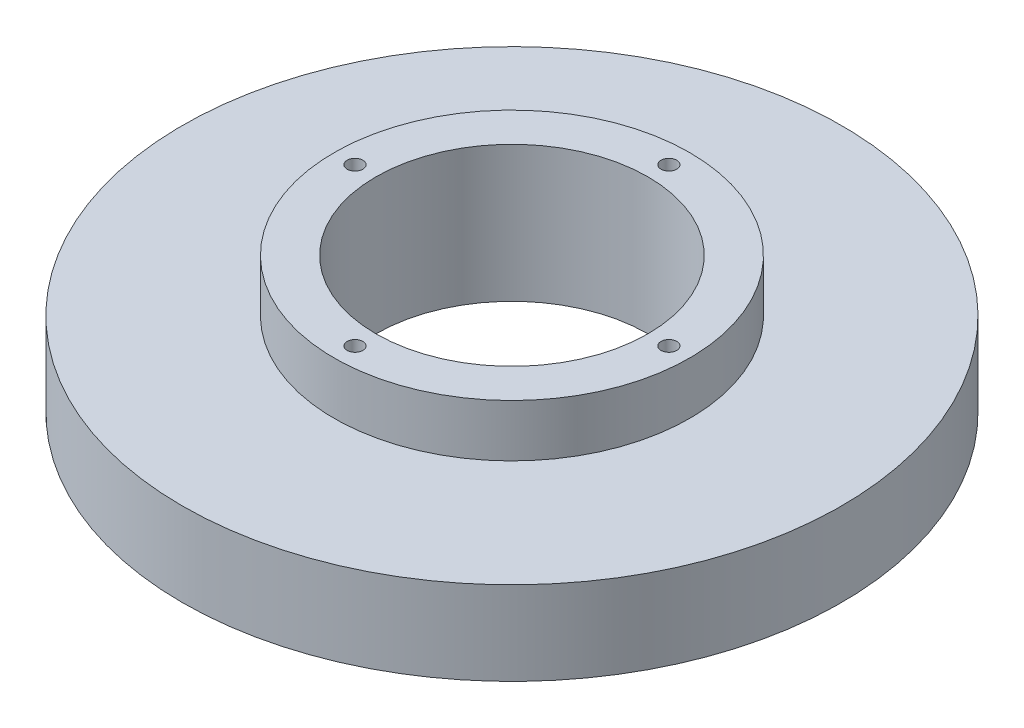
ISO-10303-21;
HEADER;
FILE_DESCRIPTION(('STEP AP214'),'2;1');
FILE_NAME('part.step','',(''),(''),'','','');
FILE_SCHEMA(('AUTOMOTIVE_DESIGN { 1 0 10303 214 1 1 1 1 }'));
ENDSEC;
DATA;
#1=APPLICATION_CONTEXT('core data for automotive mechanical design processes');
#2=APPLICATION_PROTOCOL_DEFINITION('international standard','automotive_design',2000,#1);
#3=PRODUCT_CONTEXT('',#1,'mechanical');
#4=PRODUCT('Part','Part','',(#3));
#5=PRODUCT_RELATED_PRODUCT_CATEGORY('part','',(#4));
#6=PRODUCT_DEFINITION_FORMATION('','',#4);
#7=PRODUCT_DEFINITION_CONTEXT('part definition',#1,'design');
#8=PRODUCT_DEFINITION('design','',#6,#7);
#9=PRODUCT_DEFINITION_SHAPE('','',#8);
#10=(LENGTH_UNIT() NAMED_UNIT(*) SI_UNIT(.MILLI.,.METRE.));
#11=(NAMED_UNIT(*) PLANE_ANGLE_UNIT() SI_UNIT($,.RADIAN.));
#12=(NAMED_UNIT(*) SI_UNIT($,.STERADIAN.) SOLID_ANGLE_UNIT());
#13=UNCERTAINTY_MEASURE_WITH_UNIT(LENGTH_MEASURE(1.E-05),#10,'distance_accuracy_value','');
#14=(GEOMETRIC_REPRESENTATION_CONTEXT(3) GLOBAL_UNCERTAINTY_ASSIGNED_CONTEXT((#13)) GLOBAL_UNIT_ASSIGNED_CONTEXT((#10,
#11,#12)) REPRESENTATION_CONTEXT('',''));
#15=CARTESIAN_POINT('',(0.,0.,0.));
#16=DIRECTION('',(0.,0.,1.));
#17=DIRECTION('',(1.,0.,0.));
#18=AXIS2_PLACEMENT_3D('',#15,#16,#17);
#19=CARTESIAN_POINT('',(0.,16.,0.));
#20=DIRECTION('',(0.,-1.,0.));
#21=DIRECTION('',(0.,0.,-1.));
#22=AXIS2_PLACEMENT_3D('',#19,#20,#21);
#23=CYLINDRICAL_SURFACE('',#22,63.);
#24=CARTESIAN_POINT('',(0.,16.,0.));
#25=DIRECTION('',(0.,1.,0.));
#26=DIRECTION('',(0.,0.,1.));
#27=AXIS2_PLACEMENT_3D('',#24,#25,#26);
#28=CIRCLE('',#27,63.);
#29=CARTESIAN_POINT('',(0.,16.,63.));
#30=VERTEX_POINT('',#29);
#31=EDGE_CURVE('E11',#30,#30,#28,.T.);
#32=ORIENTED_EDGE('',*,*,#31,.F.);
#33=EDGE_LOOP('',(#32));
#34=FACE_BOUND('',#33,.T.);
#35=CARTESIAN_POINT('',(0.,0.,0.));
#36=DIRECTION('',(0.,1.,0.));
#37=DIRECTION('',(0.,0.,1.));
#38=AXIS2_PLACEMENT_3D('',#35,#36,#37);
#39=CIRCLE('',#38,63.);
#40=CARTESIAN_POINT('',(0.,0.,63.));
#41=VERTEX_POINT('',#40);
#42=EDGE_CURVE('E41',#41,#41,#39,.T.);
#43=ORIENTED_EDGE('',*,*,#42,.T.);
#44=EDGE_LOOP('',(#43));
#45=FACE_BOUND('',#44,.T.);
#46=ADVANCED_FACE('F38',(#34,#45),#23,.T.);
#47=CARTESIAN_POINT('',(0.,16.,0.));
#48=DIRECTION('',(0.,1.,0.));
#49=DIRECTION('',(0.,0.,1.));
#50=AXIS2_PLACEMENT_3D('',#47,#48,#49);
#51=PLANE('',#50);
#52=CARTESIAN_POINT('',(0.,16.,0.));
#53=DIRECTION('',(0.,1.,0.));
#54=DIRECTION('',(0.,0.,1.));
#55=AXIS2_PLACEMENT_3D('',#52,#53,#54);
#56=CIRCLE('',#55,34.);
#57=CARTESIAN_POINT('',(0.,16.,-34.));
#58=VERTEX_POINT('',#57);
#59=EDGE_CURVE('E45',#58,#58,#56,.T.);
#60=ORIENTED_EDGE('',*,*,#59,.F.);
#61=EDGE_LOOP('',(#60));
#62=FACE_BOUND('',#61,.T.);
#63=ORIENTED_EDGE('',*,*,#31,.T.);
#64=EDGE_LOOP('',(#63));
#65=FACE_BOUND('',#64,.T.);
#66=ADVANCED_FACE('F118',(#62,#65),#51,.T.);
#67=CARTESIAN_POINT('',(0.,0.,0.));
#68=DIRECTION('',(0.,1.,0.));
#69=DIRECTION('',(0.,0.,1.));
#70=AXIS2_PLACEMENT_3D('',#67,#68,#69);
#71=PLANE('',#70);
#72=CARTESIAN_POINT('',(30.,0.,0.));
#73=DIRECTION('',(0.,1.,0.));
#74=DIRECTION('',(0.,0.,1.));
#75=AXIS2_PLACEMENT_3D('',#72,#73,#74);
#76=CIRCLE('',#75,1.5);
#77=CARTESIAN_POINT('',(30.,0.,1.5));
#78=VERTEX_POINT('',#77);
#79=EDGE_CURVE('E58',#78,#78,#76,.T.);
#80=ORIENTED_EDGE('',*,*,#79,.T.);
#81=EDGE_LOOP('',(#80));
#82=FACE_BOUND('',#81,.T.);
#83=CARTESIAN_POINT('',(-1.04744440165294E-13,0.,30.));
#84=DIRECTION('',(0.,1.,0.));
#85=DIRECTION('',(0.,0.,1.));
#86=AXIS2_PLACEMENT_3D('',#83,#84,#85);
#87=CIRCLE('',#86,1.5);
#88=CARTESIAN_POINT('',(-1.04744440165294E-13,0.,31.5));
#89=VERTEX_POINT('',#88);
#90=EDGE_CURVE('E76',#89,#89,#87,.T.);
#91=ORIENTED_EDGE('',*,*,#90,.T.);
#92=EDGE_LOOP('',(#91));
#93=FACE_BOUND('',#92,.T.);
#94=CARTESIAN_POINT('',(-30.,0.,-2.09488880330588E-13));
#95=DIRECTION('',(0.,1.,0.));
#96=DIRECTION('',(0.,0.,1.));
#97=AXIS2_PLACEMENT_3D('',#94,#95,#96);
#98=CIRCLE('',#97,1.5);
#99=CARTESIAN_POINT('',(-30.,0.,1.49999999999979));
#100=VERTEX_POINT('',#99);
#101=EDGE_CURVE('E70',#100,#100,#98,.T.);
#102=ORIENTED_EDGE('',*,*,#101,.T.);
#103=EDGE_LOOP('',(#102));
#104=FACE_BOUND('',#103,.T.);
#105=CARTESIAN_POINT('',(3.14233320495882E-13,0.,-30.));
#106=DIRECTION('',(0.,1.,0.));
#107=DIRECTION('',(0.,0.,1.));
#108=AXIS2_PLACEMENT_3D('',#105,#106,#107);
#109=CIRCLE('',#108,1.5);
#110=CARTESIAN_POINT('',(3.14233320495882E-13,0.,-28.5));
#111=VERTEX_POINT('',#110);
#112=EDGE_CURVE('E64',#111,#111,#109,.T.);
#113=ORIENTED_EDGE('',*,*,#112,.T.);
#114=EDGE_LOOP('',(#113));
#115=FACE_BOUND('',#114,.T.);
#116=ORIENTED_EDGE('',*,*,#42,.F.);
#117=EDGE_LOOP('',(#116));
#118=FACE_BOUND('',#117,.T.);
#119=CARTESIAN_POINT('',(0.,0.,0.));
#120=DIRECTION('',(0.,1.,0.));
#121=DIRECTION('',(0.,0.,1.));
#122=AXIS2_PLACEMENT_3D('',#119,#120,#121);
#123=CIRCLE('',#122,26.);
#124=CARTESIAN_POINT('',(0.,0.,-26.));
#125=VERTEX_POINT('',#124);
#126=EDGE_CURVE('E55',#125,#125,#123,.T.);
#127=ORIENTED_EDGE('',*,*,#126,.T.);
#128=EDGE_LOOP('',(#127));
#129=FACE_BOUND('',#128,.T.);
#130=ADVANCED_FACE('F85',(#82,#93,#104,#115,#118,#129),#71,.F.);
#131=CARTESIAN_POINT('',(0.,26.,0.));
#132=DIRECTION('',(0.,1.,0.));
#133=DIRECTION('',(0.,0.,1.));
#134=AXIS2_PLACEMENT_3D('',#131,#132,#133);
#135=PLANE('',#134);
#136=CARTESIAN_POINT('',(30.,26.,0.));
#137=DIRECTION('',(0.,1.,0.));
#138=DIRECTION('',(0.,0.,1.));
#139=AXIS2_PLACEMENT_3D('',#136,#137,#138);
#140=CIRCLE('',#139,1.5);
#141=CARTESIAN_POINT('',(30.,26.,1.5));
#142=VERTEX_POINT('',#141);
#143=EDGE_CURVE('E79',#142,#142,#140,.T.);
#144=ORIENTED_EDGE('',*,*,#143,.F.);
#145=EDGE_LOOP('',(#144));
#146=FACE_BOUND('',#145,.T.);
#147=CARTESIAN_POINT('',(-1.04744440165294E-13,26.,30.));
#148=DIRECTION('',(0.,1.,0.));
#149=DIRECTION('',(0.,0.,1.));
#150=AXIS2_PLACEMENT_3D('',#147,#148,#149);
#151=CIRCLE('',#150,1.5);
#152=CARTESIAN_POINT('',(-1.04744440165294E-13,26.,31.5));
#153=VERTEX_POINT('',#152);
#154=EDGE_CURVE('E73',#153,#153,#151,.T.);
#155=ORIENTED_EDGE('',*,*,#154,.F.);
#156=EDGE_LOOP('',(#155));
#157=FACE_BOUND('',#156,.T.);
#158=CARTESIAN_POINT('',(-30.,26.,-2.09488880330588E-13));
#159=DIRECTION('',(0.,1.,0.));
#160=DIRECTION('',(0.,0.,1.));
#161=AXIS2_PLACEMENT_3D('',#158,#159,#160);
#162=CIRCLE('',#161,1.5);
#163=CARTESIAN_POINT('',(-30.,26.,1.49999999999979));
#164=VERTEX_POINT('',#163);
#165=EDGE_CURVE('E67',#164,#164,#162,.T.);
#166=ORIENTED_EDGE('',*,*,#165,.F.);
#167=EDGE_LOOP('',(#166));
#168=FACE_BOUND('',#167,.T.);
#169=CARTESIAN_POINT('',(3.14233320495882E-13,26.,-30.));
#170=DIRECTION('',(0.,1.,0.));
#171=DIRECTION('',(0.,0.,1.));
#172=AXIS2_PLACEMENT_3D('',#169,#170,#171);
#173=CIRCLE('',#172,1.5);
#174=CARTESIAN_POINT('',(3.14233320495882E-13,26.,-28.5));
#175=VERTEX_POINT('',#174);
#176=EDGE_CURVE('E61',#175,#175,#173,.T.);
#177=ORIENTED_EDGE('',*,*,#176,.F.);
#178=EDGE_LOOP('',(#177));
#179=FACE_BOUND('',#178,.T.);
#180=CARTESIAN_POINT('',(0.,26.,0.));
#181=DIRECTION('',(0.,1.,0.));
#182=DIRECTION('',(0.,0.,1.));
#183=AXIS2_PLACEMENT_3D('',#180,#181,#182);
#184=CIRCLE('',#183,34.);
#185=CARTESIAN_POINT('',(0.,26.,-34.));
#186=VERTEX_POINT('',#185);
#187=EDGE_CURVE('E51',#186,#186,#184,.T.);
#188=ORIENTED_EDGE('',*,*,#187,.T.);
#189=EDGE_LOOP('',(#188));
#190=FACE_BOUND('',#189,.T.);
#191=CARTESIAN_POINT('',(0.,26.,0.));
#192=DIRECTION('',(0.,1.,0.));
#193=DIRECTION('',(0.,0.,1.));
#194=AXIS2_PLACEMENT_3D('',#191,#192,#193);
#195=CIRCLE('',#194,26.);
#196=CARTESIAN_POINT('',(0.,26.,-26.));
#197=VERTEX_POINT('',#196);
#198=EDGE_CURVE('E54',#197,#197,#195,.T.);
#199=ORIENTED_EDGE('',*,*,#198,.F.);
#200=EDGE_LOOP('',(#199));
#201=FACE_BOUND('',#200,.T.);
#202=ADVANCED_FACE('F95',(#146,#157,#168,#179,#190,#201),#135,.T.);
#203=CARTESIAN_POINT('',(0.,26.,0.));
#204=DIRECTION('',(0.,-1.,0.));
#205=DIRECTION('',(0.,0.,-1.));
#206=AXIS2_PLACEMENT_3D('',#203,#204,#205);
#207=CYLINDRICAL_SURFACE('',#206,34.);
#208=CARTESIAN_POINT('',(0.,16.,-34.));
#209=CARTESIAN_POINT('',(0.,16.1041666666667,-34.));
#210=CARTESIAN_POINT('',(0.,16.2083333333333,-34.));
#211=CARTESIAN_POINT('',(0.,16.4166666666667,-34.));
#212=CARTESIAN_POINT('',(0.,16.5208333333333,-34.));
#213=CARTESIAN_POINT('',(0.,16.7291666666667,-34.));
#214=CARTESIAN_POINT('',(0.,16.8333333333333,-34.));
#215=CARTESIAN_POINT('',(0.,17.0416666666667,-34.));
#216=CARTESIAN_POINT('',(0.,17.1458333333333,-34.));
#217=CARTESIAN_POINT('',(0.,17.3541666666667,-34.));
#218=CARTESIAN_POINT('',(0.,17.4583333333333,-34.));
#219=CARTESIAN_POINT('',(0.,17.6666666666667,-34.));
#220=CARTESIAN_POINT('',(0.,17.7708333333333,-34.));
#221=CARTESIAN_POINT('',(0.,17.9791666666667,-34.));
#222=CARTESIAN_POINT('',(0.,18.0833333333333,-34.));
#223=CARTESIAN_POINT('',(0.,18.2916666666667,-34.));
#224=CARTESIAN_POINT('',(0.,18.3958333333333,-34.));
#225=CARTESIAN_POINT('',(0.,18.6041666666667,-34.));
#226=CARTESIAN_POINT('',(0.,18.7083333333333,-34.));
#227=CARTESIAN_POINT('',(0.,18.9166666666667,-34.));
#228=CARTESIAN_POINT('',(0.,19.0208333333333,-34.));
#229=CARTESIAN_POINT('',(0.,19.2291666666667,-34.));
#230=CARTESIAN_POINT('',(0.,19.3333333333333,-34.));
#231=CARTESIAN_POINT('',(0.,19.5416666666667,-34.));
#232=CARTESIAN_POINT('',(0.,19.6458333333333,-34.));
#233=CARTESIAN_POINT('',(0.,19.8541666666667,-34.));
#234=CARTESIAN_POINT('',(0.,19.9583333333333,-34.));
#235=CARTESIAN_POINT('',(0.,20.1666666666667,-34.));
#236=CARTESIAN_POINT('',(0.,20.2708333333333,-34.));
#237=CARTESIAN_POINT('',(0.,20.4791666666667,-34.));
#238=CARTESIAN_POINT('',(0.,20.5833333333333,-34.));
#239=CARTESIAN_POINT('',(0.,20.7916666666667,-34.));
#240=CARTESIAN_POINT('',(0.,20.8958333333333,-34.));
#241=CARTESIAN_POINT('',(0.,21.1041666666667,-34.));
#242=CARTESIAN_POINT('',(0.,21.2083333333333,-34.));
#243=CARTESIAN_POINT('',(0.,21.4166666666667,-34.));
#244=CARTESIAN_POINT('',(0.,21.5208333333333,-34.));
#245=CARTESIAN_POINT('',(0.,21.7291666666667,-34.));
#246=CARTESIAN_POINT('',(0.,21.8333333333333,-34.));
#247=CARTESIAN_POINT('',(0.,22.0416666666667,-34.));
#248=CARTESIAN_POINT('',(0.,22.1458333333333,-34.));
#249=CARTESIAN_POINT('',(0.,22.3541666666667,-34.));
#250=CARTESIAN_POINT('',(0.,22.4583333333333,-34.));
#251=CARTESIAN_POINT('',(0.,22.6666666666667,-34.));
#252=CARTESIAN_POINT('',(0.,22.7708333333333,-34.));
#253=CARTESIAN_POINT('',(0.,22.9791666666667,-34.));
#254=CARTESIAN_POINT('',(0.,23.0833333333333,-34.));
#255=CARTESIAN_POINT('',(0.,23.2916666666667,-34.));
#256=CARTESIAN_POINT('',(0.,23.3958333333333,-34.));
#257=CARTESIAN_POINT('',(0.,23.6041666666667,-34.));
#258=CARTESIAN_POINT('',(0.,23.7083333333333,-34.));
#259=CARTESIAN_POINT('',(0.,23.9166666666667,-34.));
#260=CARTESIAN_POINT('',(0.,24.0208333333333,-34.));
#261=CARTESIAN_POINT('',(0.,24.2291666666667,-34.));
#262=CARTESIAN_POINT('',(0.,24.3333333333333,-34.));
#263=CARTESIAN_POINT('',(0.,24.5416666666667,-34.));
#264=CARTESIAN_POINT('',(0.,24.6458333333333,-34.));
#265=CARTESIAN_POINT('',(0.,24.8541666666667,-34.));
#266=CARTESIAN_POINT('',(0.,24.9583333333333,-34.));
#267=CARTESIAN_POINT('',(0.,25.1666666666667,-34.));
#268=CARTESIAN_POINT('',(0.,25.2708333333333,-34.));
#269=CARTESIAN_POINT('',(0.,25.4791666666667,-34.));
#270=CARTESIAN_POINT('',(0.,25.5833333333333,-34.));
#271=CARTESIAN_POINT('',(0.,25.7916666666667,-34.));
#272=CARTESIAN_POINT('',(0.,25.8958333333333,-34.));
#273=CARTESIAN_POINT('',(0.,26.,-34.));
#274=B_SPLINE_CURVE_WITH_KNOTS('',3,(#208,#209,#210,#211,#212,#213,#214,#215,#216,#217,#218,
#219,#220,#221,#222,#223,#224,#225,#226,#227,#228,#229,#230,#231,#232,#233,#234,#235,#236,#237,
#238,#239,#240,#241,#242,#243,#244,#245,#246,#247,#248,#249,#250,#251,#252,#253,#254,#255,#256,
#257,#258,#259,#260,#261,#262,#263,#264,#265,#266,#267,#268,#269,#270,#271,#272,#273),
.UNSPECIFIED.,.F.,.F.,(4,2,2,2,2,2,2,2,2,2,2,2,2,2,2,2,2,2,2,2,2,2,2,2,2,2,2,2,2,2,2,2,4),(0.,
0.3125,0.625000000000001,0.937500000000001,1.25,1.5625,1.875,2.1875,2.5,2.8125,3.125,3.4375,
3.75,4.0625,4.375,4.6875,5.,5.3125,5.625,5.9375,6.25,6.5625,6.875,7.1875,7.5,7.8125,8.125,
8.4375,8.75,9.0625,9.375,9.6875,10.),.UNSPECIFIED.);
#275=EDGE_CURVE('BSEAM98',#58,#186,#274,.T.);
#276=ORIENTED_EDGE('',*,*,#59,.T.);
#277=ORIENTED_EDGE('',*,*,#187,.F.);
#278=ORIENTED_EDGE('',*,*,#275,.T.);
#279=ORIENTED_EDGE('',*,*,#275,.F.);
#280=EDGE_LOOP('',(#276,#278,#277,#279));
#281=FACE_BOUND('',#280,.T.);
#282=ADVANCED_FACE('F98',(#281),#207,.T.);
#283=CARTESIAN_POINT('',(0.,26.,0.));
#284=DIRECTION('',(0.,-1.,0.));
#285=DIRECTION('',(0.,0.,-1.));
#286=AXIS2_PLACEMENT_3D('',#283,#284,#285);
#287=CYLINDRICAL_SURFACE('',#286,26.);
#288=CARTESIAN_POINT('',(0.,26.,-26.));
#289=CARTESIAN_POINT('',(0.,25.7291666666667,-26.));
#290=CARTESIAN_POINT('',(0.,25.4583333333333,-26.));
#291=CARTESIAN_POINT('',(0.,24.9166666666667,-26.));
#292=CARTESIAN_POINT('',(0.,24.6458333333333,-26.));
#293=CARTESIAN_POINT('',(0.,24.1041666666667,-26.));
#294=CARTESIAN_POINT('',(0.,23.8333333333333,-26.));
#295=CARTESIAN_POINT('',(0.,23.2916666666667,-26.));
#296=CARTESIAN_POINT('',(0.,23.0208333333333,-26.));
#297=CARTESIAN_POINT('',(0.,22.4791666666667,-26.));
#298=CARTESIAN_POINT('',(0.,22.2083333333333,-26.));
#299=CARTESIAN_POINT('',(0.,21.6666666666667,-26.));
#300=CARTESIAN_POINT('',(0.,21.3958333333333,-26.));
#301=CARTESIAN_POINT('',(0.,20.8541666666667,-26.));
#302=CARTESIAN_POINT('',(0.,20.5833333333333,-26.));
#303=CARTESIAN_POINT('',(0.,20.0416666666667,-26.));
#304=CARTESIAN_POINT('',(0.,19.7708333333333,-26.));
#305=CARTESIAN_POINT('',(0.,19.2291666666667,-26.));
#306=CARTESIAN_POINT('',(0.,18.9583333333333,-26.));
#307=CARTESIAN_POINT('',(0.,18.4166666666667,-26.));
#308=CARTESIAN_POINT('',(0.,18.1458333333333,-26.));
#309=CARTESIAN_POINT('',(0.,17.6041666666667,-26.));
#310=CARTESIAN_POINT('',(0.,17.3333333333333,-26.));
#311=CARTESIAN_POINT('',(0.,16.7916666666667,-26.));
#312=CARTESIAN_POINT('',(0.,16.5208333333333,-26.));
#313=CARTESIAN_POINT('',(0.,15.9791666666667,-26.));
#314=CARTESIAN_POINT('',(0.,15.7083333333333,-26.));
#315=CARTESIAN_POINT('',(0.,15.1666666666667,-26.));
#316=CARTESIAN_POINT('',(0.,14.8958333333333,-26.));
#317=CARTESIAN_POINT('',(0.,14.3541666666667,-26.));
#318=CARTESIAN_POINT('',(0.,14.0833333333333,-26.));
#319=CARTESIAN_POINT('',(0.,13.5416666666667,-26.));
#320=CARTESIAN_POINT('',(0.,13.2708333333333,-26.));
#321=CARTESIAN_POINT('',(0.,12.7291666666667,-26.));
#322=CARTESIAN_POINT('',(0.,12.4583333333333,-26.));
#323=CARTESIAN_POINT('',(0.,11.9166666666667,-26.));
#324=CARTESIAN_POINT('',(0.,11.6458333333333,-26.));
#325=CARTESIAN_POINT('',(0.,11.1041666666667,-26.));
#326=CARTESIAN_POINT('',(0.,10.8333333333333,-26.));
#327=CARTESIAN_POINT('',(0.,10.2916666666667,-26.));
#328=CARTESIAN_POINT('',(0.,10.0208333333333,-26.));
#329=CARTESIAN_POINT('',(0.,9.47916666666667,-26.));
#330=CARTESIAN_POINT('',(0.,9.20833333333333,-26.));
#331=CARTESIAN_POINT('',(0.,8.66666666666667,-26.));
#332=CARTESIAN_POINT('',(0.,8.39583333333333,-26.));
#333=CARTESIAN_POINT('',(0.,7.85416666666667,-26.));
#334=CARTESIAN_POINT('',(0.,7.58333333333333,-26.));
#335=CARTESIAN_POINT('',(0.,7.04166666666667,-26.));
#336=CARTESIAN_POINT('',(0.,6.77083333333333,-26.));
#337=CARTESIAN_POINT('',(0.,6.22916666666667,-26.));
#338=CARTESIAN_POINT('',(0.,5.95833333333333,-26.));
#339=CARTESIAN_POINT('',(0.,5.41666666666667,-26.));
#340=CARTESIAN_POINT('',(0.,5.14583333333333,-26.));
#341=CARTESIAN_POINT('',(0.,4.60416666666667,-26.));
#342=CARTESIAN_POINT('',(0.,4.33333333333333,-26.));
#343=CARTESIAN_POINT('',(0.,3.79166666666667,-26.));
#344=CARTESIAN_POINT('',(0.,3.52083333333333,-26.));
#345=CARTESIAN_POINT('',(0.,2.97916666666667,-26.));
#346=CARTESIAN_POINT('',(0.,2.70833333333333,-26.));
#347=CARTESIAN_POINT('',(0.,2.16666666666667,-26.));
#348=CARTESIAN_POINT('',(0.,1.89583333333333,-26.));
#349=CARTESIAN_POINT('',(0.,1.35416666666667,-26.));
#350=CARTESIAN_POINT('',(0.,1.08333333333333,-26.));
#351=CARTESIAN_POINT('',(0.,0.541666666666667,-26.));
#352=CARTESIAN_POINT('',(0.,0.270833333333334,-26.));
#353=CARTESIAN_POINT('',(0.,0.,-26.));
#354=B_SPLINE_CURVE_WITH_KNOTS('',3,(#288,#289,#290,#291,#292,#293,#294,#295,#296,#297,#298,
#299,#300,#301,#302,#303,#304,#305,#306,#307,#308,#309,#310,#311,#312,#313,#314,#315,#316,#317,
#318,#319,#320,#321,#322,#323,#324,#325,#326,#327,#328,#329,#330,#331,#332,#333,#334,#335,#336,
#337,#338,#339,#340,#341,#342,#343,#344,#345,#346,#347,#348,#349,#350,#351,#352,#353),
.UNSPECIFIED.,.F.,.F.,(4,2,2,2,2,2,2,2,2,2,2,2,2,2,2,2,2,2,2,2,2,2,2,2,2,2,2,2,2,2,2,2,4),(0.,
0.812499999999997,1.625,2.4375,3.25,4.0625,4.875,5.6875,6.5,7.3125,8.125,8.93749999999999,
9.74999999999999,10.5625,11.375,12.1875,13.,13.8125,14.625,15.4375,16.25,17.0625,17.875,18.6875,
19.5,20.3125,21.125,21.9375,22.75,23.5625,24.375,25.1875,26.),.UNSPECIFIED.);
#355=EDGE_CURVE('BSEAM110',#197,#125,#354,.T.);
#356=ORIENTED_EDGE('',*,*,#198,.T.);
#357=ORIENTED_EDGE('',*,*,#126,.F.);
#358=ORIENTED_EDGE('',*,*,#355,.T.);
#359=ORIENTED_EDGE('',*,*,#355,.F.);
#360=EDGE_LOOP('',(#356,#358,#357,#359));
#361=FACE_BOUND('',#360,.T.);
#362=ADVANCED_FACE('F110',(#361),#287,.F.);
#363=CARTESIAN_POINT('',(3.14233320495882E-13,0.,-30.));
#364=DIRECTION('',(0.,1.,0.));
#365=DIRECTION('',(0.,0.,1.));
#366=AXIS2_PLACEMENT_3D('',#363,#364,#365);
#367=CYLINDRICAL_SURFACE('',#366,1.5);
#368=CARTESIAN_POINT('',(3.14233320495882E-13,0.,-28.5));
#369=CARTESIAN_POINT('',(3.14233320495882E-13,0.270833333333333,-28.5));
#370=CARTESIAN_POINT('',(3.14233320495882E-13,0.541666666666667,-28.5));
#371=CARTESIAN_POINT('',(3.14233320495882E-13,1.08333333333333,-28.5));
#372=CARTESIAN_POINT('',(3.14233320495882E-13,1.35416666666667,-28.5));
#373=CARTESIAN_POINT('',(3.14233320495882E-13,1.89583333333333,-28.5));
#374=CARTESIAN_POINT('',(3.14233320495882E-13,2.16666666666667,-28.5));
#375=CARTESIAN_POINT('',(3.14233320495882E-13,2.70833333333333,-28.5));
#376=CARTESIAN_POINT('',(3.14233320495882E-13,2.97916666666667,-28.5));
#377=CARTESIAN_POINT('',(3.14233320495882E-13,3.52083333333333,-28.5));
#378=CARTESIAN_POINT('',(3.14233320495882E-13,3.79166666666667,-28.5));
#379=CARTESIAN_POINT('',(3.14233320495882E-13,4.33333333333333,-28.5));
#380=CARTESIAN_POINT('',(3.14233320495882E-13,4.60416666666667,-28.5));
#381=CARTESIAN_POINT('',(3.14233320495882E-13,5.14583333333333,-28.5));
#382=CARTESIAN_POINT('',(3.14233320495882E-13,5.41666666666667,-28.5));
#383=CARTESIAN_POINT('',(3.14233320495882E-13,5.95833333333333,-28.5));
#384=CARTESIAN_POINT('',(3.14233320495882E-13,6.22916666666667,-28.5));
#385=CARTESIAN_POINT('',(3.14233320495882E-13,6.77083333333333,-28.5));
#386=CARTESIAN_POINT('',(3.14233320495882E-13,7.04166666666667,-28.5));
#387=CARTESIAN_POINT('',(3.14233320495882E-13,7.58333333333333,-28.5));
#388=CARTESIAN_POINT('',(3.14233320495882E-13,7.85416666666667,-28.5));
#389=CARTESIAN_POINT('',(3.14233320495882E-13,8.39583333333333,-28.5));
#390=CARTESIAN_POINT('',(3.14233320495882E-13,8.66666666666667,-28.5));
#391=CARTESIAN_POINT('',(3.14233320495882E-13,9.20833333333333,-28.5));
#392=CARTESIAN_POINT('',(3.14233320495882E-13,9.47916666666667,-28.5));
#393=CARTESIAN_POINT('',(3.14233320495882E-13,10.0208333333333,-28.5));
#394=CARTESIAN_POINT('',(3.14233320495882E-13,10.2916666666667,-28.5));
#395=CARTESIAN_POINT('',(3.14233320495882E-13,10.8333333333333,-28.5));
#396=CARTESIAN_POINT('',(3.14233320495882E-13,11.1041666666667,-28.5));
#397=CARTESIAN_POINT('',(3.14233320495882E-13,11.6458333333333,-28.5));
#398=CARTESIAN_POINT('',(3.14233320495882E-13,11.9166666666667,-28.5));
#399=CARTESIAN_POINT('',(3.14233320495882E-13,12.4583333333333,-28.5));
#400=CARTESIAN_POINT('',(3.14233320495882E-13,12.7291666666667,-28.5));
#401=CARTESIAN_POINT('',(3.14233320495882E-13,13.2708333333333,-28.5));
#402=CARTESIAN_POINT('',(3.14233320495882E-13,13.5416666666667,-28.5));
#403=CARTESIAN_POINT('',(3.14233320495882E-13,14.0833333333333,-28.5));
#404=CARTESIAN_POINT('',(3.14233320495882E-13,14.3541666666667,-28.5));
#405=CARTESIAN_POINT('',(3.14233320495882E-13,14.8958333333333,-28.5));
#406=CARTESIAN_POINT('',(3.14233320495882E-13,15.1666666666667,-28.5));
#407=CARTESIAN_POINT('',(3.14233320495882E-13,15.7083333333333,-28.5));
#408=CARTESIAN_POINT('',(3.14233320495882E-13,15.9791666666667,-28.5));
#409=CARTESIAN_POINT('',(3.14233320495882E-13,16.5208333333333,-28.5));
#410=CARTESIAN_POINT('',(3.14233320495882E-13,16.7916666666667,-28.5));
#411=CARTESIAN_POINT('',(3.14233320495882E-13,17.3333333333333,-28.5));
#412=CARTESIAN_POINT('',(3.14233320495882E-13,17.6041666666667,-28.5));
#413=CARTESIAN_POINT('',(3.14233320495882E-13,18.1458333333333,-28.5));
#414=CARTESIAN_POINT('',(3.14233320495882E-13,18.4166666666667,-28.5));
#415=CARTESIAN_POINT('',(3.14233320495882E-13,18.9583333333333,-28.5));
#416=CARTESIAN_POINT('',(3.14233320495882E-13,19.2291666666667,-28.5));
#417=CARTESIAN_POINT('',(3.14233320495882E-13,19.7708333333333,-28.5));
#418=CARTESIAN_POINT('',(3.14233320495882E-13,20.0416666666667,-28.5));
#419=CARTESIAN_POINT('',(3.14233320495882E-13,20.5833333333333,-28.5));
#420=CARTESIAN_POINT('',(3.14233320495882E-13,20.8541666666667,-28.5));
#421=CARTESIAN_POINT('',(3.14233320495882E-13,21.3958333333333,-28.5));
#422=CARTESIAN_POINT('',(3.14233320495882E-13,21.6666666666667,-28.5));
#423=CARTESIAN_POINT('',(3.14233320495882E-13,22.2083333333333,-28.5));
#424=CARTESIAN_POINT('',(3.14233320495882E-13,22.4791666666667,-28.5));
#425=CARTESIAN_POINT('',(3.14233320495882E-13,23.0208333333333,-28.5));
#426=CARTESIAN_POINT('',(3.14233320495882E-13,23.2916666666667,-28.5));
#427=CARTESIAN_POINT('',(3.14233320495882E-13,23.8333333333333,-28.5));
#428=CARTESIAN_POINT('',(3.14233320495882E-13,24.1041666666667,-28.5));
#429=CARTESIAN_POINT('',(3.14233320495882E-13,24.6458333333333,-28.5));
#430=CARTESIAN_POINT('',(3.14233320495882E-13,24.9166666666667,-28.5));
#431=CARTESIAN_POINT('',(3.14233320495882E-13,25.4583333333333,-28.5));
#432=CARTESIAN_POINT('',(3.14233320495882E-13,25.7291666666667,-28.5));
#433=CARTESIAN_POINT('',(3.14233320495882E-13,26.,-28.5));
#434=B_SPLINE_CURVE_WITH_KNOTS('',3,(#368,#369,#370,#371,#372,#373,#374,#375,#376,#377,#378,
#379,#380,#381,#382,#383,#384,#385,#386,#387,#388,#389,#390,#391,#392,#393,#394,#395,#396,#397,
#398,#399,#400,#401,#402,#403,#404,#405,#406,#407,#408,#409,#410,#411,#412,#413,#414,#415,#416,
#417,#418,#419,#420,#421,#422,#423,#424,#425,#426,#427,#428,#429,#430,#431,#432,#433),
.UNSPECIFIED.,.F.,.F.,(4,2,2,2,2,2,2,2,2,2,2,2,2,2,2,2,2,2,2,2,2,2,2,2,2,2,2,2,2,2,2,2,4),(0.,
0.8125,1.625,2.4375,3.25,4.0625,4.875,5.6875,6.5,7.3125,8.125,8.9375,9.75,10.5625,11.375,
12.1875,13.,13.8125,14.625,15.4375,16.25,17.0625,17.875,18.6875,19.5,20.3125,21.125,21.9375,
22.75,23.5625,24.375,25.1875,26.),.UNSPECIFIED.);
#435=EDGE_CURVE('BSEAM113',#111,#175,#434,.T.);
#436=ORIENTED_EDGE('',*,*,#112,.F.);
#437=ORIENTED_EDGE('',*,*,#176,.T.);
#438=ORIENTED_EDGE('',*,*,#435,.T.);
#439=ORIENTED_EDGE('',*,*,#435,.F.);
#440=EDGE_LOOP('',(#436,#438,#437,#439));
#441=FACE_BOUND('',#440,.T.);
#442=ADVANCED_FACE('F113',(#441),#367,.F.);
#443=CARTESIAN_POINT('',(-30.,0.,-2.09488880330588E-13));
#444=DIRECTION('',(0.,1.,0.));
#445=DIRECTION('',(0.,0.,1.));
#446=AXIS2_PLACEMENT_3D('',#443,#444,#445);
#447=CYLINDRICAL_SURFACE('',#446,1.5);
#448=CARTESIAN_POINT('',(-30.,0.,1.49999999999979));
#449=CARTESIAN_POINT('',(-30.,0.270833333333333,1.49999999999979));
#450=CARTESIAN_POINT('',(-30.,0.541666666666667,1.49999999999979));
#451=CARTESIAN_POINT('',(-30.,1.08333333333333,1.49999999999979));
#452=CARTESIAN_POINT('',(-30.,1.35416666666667,1.49999999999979));
#453=CARTESIAN_POINT('',(-30.,1.89583333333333,1.49999999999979));
#454=CARTESIAN_POINT('',(-30.,2.16666666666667,1.49999999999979));
#455=CARTESIAN_POINT('',(-30.,2.70833333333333,1.49999999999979));
#456=CARTESIAN_POINT('',(-30.,2.97916666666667,1.49999999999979));
#457=CARTESIAN_POINT('',(-30.,3.52083333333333,1.49999999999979));
#458=CARTESIAN_POINT('',(-30.,3.79166666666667,1.49999999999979));
#459=CARTESIAN_POINT('',(-30.,4.33333333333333,1.49999999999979));
#460=CARTESIAN_POINT('',(-30.,4.60416666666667,1.49999999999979));
#461=CARTESIAN_POINT('',(-30.,5.14583333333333,1.49999999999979));
#462=CARTESIAN_POINT('',(-30.,5.41666666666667,1.49999999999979));
#463=CARTESIAN_POINT('',(-30.,5.95833333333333,1.49999999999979));
#464=CARTESIAN_POINT('',(-30.,6.22916666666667,1.49999999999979));
#465=CARTESIAN_POINT('',(-30.,6.77083333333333,1.49999999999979));
#466=CARTESIAN_POINT('',(-30.,7.04166666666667,1.49999999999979));
#467=CARTESIAN_POINT('',(-30.,7.58333333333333,1.49999999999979));
#468=CARTESIAN_POINT('',(-30.,7.85416666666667,1.49999999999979));
#469=CARTESIAN_POINT('',(-30.,8.39583333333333,1.49999999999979));
#470=CARTESIAN_POINT('',(-30.,8.66666666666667,1.49999999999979));
#471=CARTESIAN_POINT('',(-30.,9.20833333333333,1.49999999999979));
#472=CARTESIAN_POINT('',(-30.,9.47916666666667,1.49999999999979));
#473=CARTESIAN_POINT('',(-30.,10.0208333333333,1.49999999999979));
#474=CARTESIAN_POINT('',(-30.,10.2916666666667,1.49999999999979));
#475=CARTESIAN_POINT('',(-30.,10.8333333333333,1.49999999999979));
#476=CARTESIAN_POINT('',(-30.,11.1041666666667,1.49999999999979));
#477=CARTESIAN_POINT('',(-30.,11.6458333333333,1.49999999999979));
#478=CARTESIAN_POINT('',(-30.,11.9166666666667,1.49999999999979));
#479=CARTESIAN_POINT('',(-30.,12.4583333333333,1.49999999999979));
#480=CARTESIAN_POINT('',(-30.,12.7291666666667,1.49999999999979));
#481=CARTESIAN_POINT('',(-30.,13.2708333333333,1.49999999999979));
#482=CARTESIAN_POINT('',(-30.,13.5416666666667,1.49999999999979));
#483=CARTESIAN_POINT('',(-30.,14.0833333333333,1.49999999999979));
#484=CARTESIAN_POINT('',(-30.,14.3541666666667,1.49999999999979));
#485=CARTESIAN_POINT('',(-30.,14.8958333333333,1.49999999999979));
#486=CARTESIAN_POINT('',(-30.,15.1666666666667,1.49999999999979));
#487=CARTESIAN_POINT('',(-30.,15.7083333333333,1.49999999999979));
#488=CARTESIAN_POINT('',(-30.,15.9791666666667,1.49999999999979));
#489=CARTESIAN_POINT('',(-30.,16.5208333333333,1.49999999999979));
#490=CARTESIAN_POINT('',(-30.,16.7916666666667,1.49999999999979));
#491=CARTESIAN_POINT('',(-30.,17.3333333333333,1.49999999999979));
#492=CARTESIAN_POINT('',(-30.,17.6041666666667,1.49999999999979));
#493=CARTESIAN_POINT('',(-30.,18.1458333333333,1.49999999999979));
#494=CARTESIAN_POINT('',(-30.,18.4166666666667,1.49999999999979));
#495=CARTESIAN_POINT('',(-30.,18.9583333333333,1.49999999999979));
#496=CARTESIAN_POINT('',(-30.,19.2291666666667,1.49999999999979));
#497=CARTESIAN_POINT('',(-30.,19.7708333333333,1.49999999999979));
#498=CARTESIAN_POINT('',(-30.,20.0416666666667,1.49999999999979));
#499=CARTESIAN_POINT('',(-30.,20.5833333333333,1.49999999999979));
#500=CARTESIAN_POINT('',(-30.,20.8541666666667,1.49999999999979));
#501=CARTESIAN_POINT('',(-30.,21.3958333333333,1.49999999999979));
#502=CARTESIAN_POINT('',(-30.,21.6666666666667,1.49999999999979));
#503=CARTESIAN_POINT('',(-30.,22.2083333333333,1.49999999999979));
#504=CARTESIAN_POINT('',(-30.,22.4791666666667,1.49999999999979));
#505=CARTESIAN_POINT('',(-30.,23.0208333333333,1.49999999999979));
#506=CARTESIAN_POINT('',(-30.,23.2916666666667,1.49999999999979));
#507=CARTESIAN_POINT('',(-30.,23.8333333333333,1.49999999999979));
#508=CARTESIAN_POINT('',(-30.,24.1041666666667,1.49999999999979));
#509=CARTESIAN_POINT('',(-30.,24.6458333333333,1.49999999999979));
#510=CARTESIAN_POINT('',(-30.,24.9166666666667,1.49999999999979));
#511=CARTESIAN_POINT('',(-30.,25.4583333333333,1.49999999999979));
#512=CARTESIAN_POINT('',(-30.,25.7291666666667,1.49999999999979));
#513=CARTESIAN_POINT('',(-30.,26.,1.49999999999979));
#514=B_SPLINE_CURVE_WITH_KNOTS('',3,(#448,#449,#450,#451,#452,#453,#454,#455,#456,#457,#458,
#459,#460,#461,#462,#463,#464,#465,#466,#467,#468,#469,#470,#471,#472,#473,#474,#475,#476,#477,
#478,#479,#480,#481,#482,#483,#484,#485,#486,#487,#488,#489,#490,#491,#492,#493,#494,#495,#496,
#497,#498,#499,#500,#501,#502,#503,#504,#505,#506,#507,#508,#509,#510,#511,#512,#513),
.UNSPECIFIED.,.F.,.F.,(4,2,2,2,2,2,2,2,2,2,2,2,2,2,2,2,2,2,2,2,2,2,2,2,2,2,2,2,2,2,2,2,4),(0.,
0.8125,1.625,2.4375,3.25,4.0625,4.875,5.6875,6.5,7.3125,8.125,8.9375,9.75,10.5625,11.375,
12.1875,13.,13.8125,14.625,15.4375,16.25,17.0625,17.875,18.6875,19.5,20.3125,21.125,21.9375,
22.75,23.5625,24.375,25.1875,26.),.UNSPECIFIED.);
#515=EDGE_CURVE('BSEAM164',#100,#164,#514,.T.);
#516=ORIENTED_EDGE('',*,*,#101,.F.);
#517=ORIENTED_EDGE('',*,*,#165,.T.);
#518=ORIENTED_EDGE('',*,*,#515,.T.);
#519=ORIENTED_EDGE('',*,*,#515,.F.);
#520=EDGE_LOOP('',(#516,#518,#517,#519));
#521=FACE_BOUND('',#520,.T.);
#522=ADVANCED_FACE('F164',(#521),#447,.F.);
#523=CARTESIAN_POINT('',(-1.04744440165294E-13,0.,30.));
#524=DIRECTION('',(0.,1.,0.));
#525=DIRECTION('',(0.,0.,1.));
#526=AXIS2_PLACEMENT_3D('',#523,#524,#525);
#527=CYLINDRICAL_SURFACE('',#526,1.5);
#528=CARTESIAN_POINT('',(-1.04744440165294E-13,0.,31.5));
#529=CARTESIAN_POINT('',(-1.04744440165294E-13,0.270833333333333,31.5));
#530=CARTESIAN_POINT('',(-1.04744440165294E-13,0.541666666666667,31.5));
#531=CARTESIAN_POINT('',(-1.04744440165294E-13,1.08333333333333,31.5));
#532=CARTESIAN_POINT('',(-1.04744440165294E-13,1.35416666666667,31.5));
#533=CARTESIAN_POINT('',(-1.04744440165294E-13,1.89583333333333,31.5));
#534=CARTESIAN_POINT('',(-1.04744440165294E-13,2.16666666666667,31.5));
#535=CARTESIAN_POINT('',(-1.04744440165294E-13,2.70833333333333,31.5));
#536=CARTESIAN_POINT('',(-1.04744440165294E-13,2.97916666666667,31.5));
#537=CARTESIAN_POINT('',(-1.04744440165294E-13,3.52083333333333,31.5));
#538=CARTESIAN_POINT('',(-1.04744440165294E-13,3.79166666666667,31.5));
#539=CARTESIAN_POINT('',(-1.04744440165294E-13,4.33333333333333,31.5));
#540=CARTESIAN_POINT('',(-1.04744440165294E-13,4.60416666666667,31.5));
#541=CARTESIAN_POINT('',(-1.04744440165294E-13,5.14583333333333,31.5));
#542=CARTESIAN_POINT('',(-1.04744440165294E-13,5.41666666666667,31.5));
#543=CARTESIAN_POINT('',(-1.04744440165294E-13,5.95833333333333,31.5));
#544=CARTESIAN_POINT('',(-1.04744440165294E-13,6.22916666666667,31.5));
#545=CARTESIAN_POINT('',(-1.04744440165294E-13,6.77083333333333,31.5));
#546=CARTESIAN_POINT('',(-1.04744440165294E-13,7.04166666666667,31.5));
#547=CARTESIAN_POINT('',(-1.04744440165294E-13,7.58333333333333,31.5));
#548=CARTESIAN_POINT('',(-1.04744440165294E-13,7.85416666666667,31.5));
#549=CARTESIAN_POINT('',(-1.04744440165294E-13,8.39583333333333,31.5));
#550=CARTESIAN_POINT('',(-1.04744440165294E-13,8.66666666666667,31.5));
#551=CARTESIAN_POINT('',(-1.04744440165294E-13,9.20833333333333,31.5));
#552=CARTESIAN_POINT('',(-1.04744440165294E-13,9.47916666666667,31.5));
#553=CARTESIAN_POINT('',(-1.04744440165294E-13,10.0208333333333,31.5));
#554=CARTESIAN_POINT('',(-1.04744440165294E-13,10.2916666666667,31.5));
#555=CARTESIAN_POINT('',(-1.04744440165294E-13,10.8333333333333,31.5));
#556=CARTESIAN_POINT('',(-1.04744440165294E-13,11.1041666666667,31.5));
#557=CARTESIAN_POINT('',(-1.04744440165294E-13,11.6458333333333,31.5));
#558=CARTESIAN_POINT('',(-1.04744440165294E-13,11.9166666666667,31.5));
#559=CARTESIAN_POINT('',(-1.04744440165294E-13,12.4583333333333,31.5));
#560=CARTESIAN_POINT('',(-1.04744440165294E-13,12.7291666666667,31.5));
#561=CARTESIAN_POINT('',(-1.04744440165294E-13,13.2708333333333,31.5));
#562=CARTESIAN_POINT('',(-1.04744440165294E-13,13.5416666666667,31.5));
#563=CARTESIAN_POINT('',(-1.04744440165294E-13,14.0833333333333,31.5));
#564=CARTESIAN_POINT('',(-1.04744440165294E-13,14.3541666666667,31.5));
#565=CARTESIAN_POINT('',(-1.04744440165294E-13,14.8958333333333,31.5));
#566=CARTESIAN_POINT('',(-1.04744440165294E-13,15.1666666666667,31.5));
#567=CARTESIAN_POINT('',(-1.04744440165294E-13,15.7083333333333,31.5));
#568=CARTESIAN_POINT('',(-1.04744440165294E-13,15.9791666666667,31.5));
#569=CARTESIAN_POINT('',(-1.04744440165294E-13,16.5208333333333,31.5));
#570=CARTESIAN_POINT('',(-1.04744440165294E-13,16.7916666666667,31.5));
#571=CARTESIAN_POINT('',(-1.04744440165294E-13,17.3333333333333,31.5));
#572=CARTESIAN_POINT('',(-1.04744440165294E-13,17.6041666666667,31.5));
#573=CARTESIAN_POINT('',(-1.04744440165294E-13,18.1458333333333,31.5));
#574=CARTESIAN_POINT('',(-1.04744440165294E-13,18.4166666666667,31.5));
#575=CARTESIAN_POINT('',(-1.04744440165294E-13,18.9583333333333,31.5));
#576=CARTESIAN_POINT('',(-1.04744440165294E-13,19.2291666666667,31.5));
#577=CARTESIAN_POINT('',(-1.04744440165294E-13,19.7708333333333,31.5));
#578=CARTESIAN_POINT('',(-1.04744440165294E-13,20.0416666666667,31.5));
#579=CARTESIAN_POINT('',(-1.04744440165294E-13,20.5833333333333,31.5));
#580=CARTESIAN_POINT('',(-1.04744440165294E-13,20.8541666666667,31.5));
#581=CARTESIAN_POINT('',(-1.04744440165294E-13,21.3958333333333,31.5));
#582=CARTESIAN_POINT('',(-1.04744440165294E-13,21.6666666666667,31.5));
#583=CARTESIAN_POINT('',(-1.04744440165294E-13,22.2083333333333,31.5));
#584=CARTESIAN_POINT('',(-1.04744440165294E-13,22.4791666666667,31.5));
#585=CARTESIAN_POINT('',(-1.04744440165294E-13,23.0208333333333,31.5));
#586=CARTESIAN_POINT('',(-1.04744440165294E-13,23.2916666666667,31.5));
#587=CARTESIAN_POINT('',(-1.04744440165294E-13,23.8333333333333,31.5));
#588=CARTESIAN_POINT('',(-1.04744440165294E-13,24.1041666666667,31.5));
#589=CARTESIAN_POINT('',(-1.04744440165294E-13,24.6458333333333,31.5));
#590=CARTESIAN_POINT('',(-1.04744440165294E-13,24.9166666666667,31.5));
#591=CARTESIAN_POINT('',(-1.04744440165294E-13,25.4583333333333,31.5));
#592=CARTESIAN_POINT('',(-1.04744440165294E-13,25.7291666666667,31.5));
#593=CARTESIAN_POINT('',(-1.04744440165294E-13,26.,31.5));
#594=B_SPLINE_CURVE_WITH_KNOTS('',3,(#528,#529,#530,#531,#532,#533,#534,#535,#536,#537,#538,
#539,#540,#541,#542,#543,#544,#545,#546,#547,#548,#549,#550,#551,#552,#553,#554,#555,#556,#557,
#558,#559,#560,#561,#562,#563,#564,#565,#566,#567,#568,#569,#570,#571,#572,#573,#574,#575,#576,
#577,#578,#579,#580,#581,#582,#583,#584,#585,#586,#587,#588,#589,#590,#591,#592,#593),
.UNSPECIFIED.,.F.,.F.,(4,2,2,2,2,2,2,2,2,2,2,2,2,2,2,2,2,2,2,2,2,2,2,2,2,2,2,2,2,2,2,2,4),(0.,
0.8125,1.625,2.4375,3.25,4.0625,4.875,5.6875,6.5,7.3125,8.125,8.9375,9.75,10.5625,11.375,
12.1875,13.,13.8125,14.625,15.4375,16.25,17.0625,17.875,18.6875,19.5,20.3125,21.125,21.9375,
22.75,23.5625,24.375,25.1875,26.),.UNSPECIFIED.);
#595=EDGE_CURVE('BSEAM91',#89,#153,#594,.T.);
#596=ORIENTED_EDGE('',*,*,#90,.F.);
#597=ORIENTED_EDGE('',*,*,#154,.T.);
#598=ORIENTED_EDGE('',*,*,#595,.T.);
#599=ORIENTED_EDGE('',*,*,#595,.F.);
#600=EDGE_LOOP('',(#596,#598,#597,#599));
#601=FACE_BOUND('',#600,.T.);
#602=ADVANCED_FACE('F91',(#601),#527,.F.);
#603=CARTESIAN_POINT('',(30.,0.,0.));
#604=DIRECTION('',(0.,1.,0.));
#605=DIRECTION('',(0.,0.,1.));
#606=AXIS2_PLACEMENT_3D('',#603,#604,#605);
#607=CYLINDRICAL_SURFACE('',#606,1.5);
#608=CARTESIAN_POINT('',(30.,0.,1.5));
#609=CARTESIAN_POINT('',(30.,0.270833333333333,1.5));
#610=CARTESIAN_POINT('',(30.,0.541666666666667,1.5));
#611=CARTESIAN_POINT('',(30.,1.08333333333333,1.5));
#612=CARTESIAN_POINT('',(30.,1.35416666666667,1.5));
#613=CARTESIAN_POINT('',(30.,1.89583333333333,1.5));
#614=CARTESIAN_POINT('',(30.,2.16666666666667,1.5));
#615=CARTESIAN_POINT('',(30.,2.70833333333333,1.5));
#616=CARTESIAN_POINT('',(30.,2.97916666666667,1.5));
#617=CARTESIAN_POINT('',(30.,3.52083333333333,1.5));
#618=CARTESIAN_POINT('',(30.,3.79166666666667,1.5));
#619=CARTESIAN_POINT('',(30.,4.33333333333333,1.5));
#620=CARTESIAN_POINT('',(30.,4.60416666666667,1.5));
#621=CARTESIAN_POINT('',(30.,5.14583333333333,1.5));
#622=CARTESIAN_POINT('',(30.,5.41666666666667,1.5));
#623=CARTESIAN_POINT('',(30.,5.95833333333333,1.5));
#624=CARTESIAN_POINT('',(30.,6.22916666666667,1.5));
#625=CARTESIAN_POINT('',(30.,6.77083333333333,1.5));
#626=CARTESIAN_POINT('',(30.,7.04166666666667,1.5));
#627=CARTESIAN_POINT('',(30.,7.58333333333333,1.5));
#628=CARTESIAN_POINT('',(30.,7.85416666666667,1.5));
#629=CARTESIAN_POINT('',(30.,8.39583333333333,1.5));
#630=CARTESIAN_POINT('',(30.,8.66666666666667,1.5));
#631=CARTESIAN_POINT('',(30.,9.20833333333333,1.5));
#632=CARTESIAN_POINT('',(30.,9.47916666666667,1.5));
#633=CARTESIAN_POINT('',(30.,10.0208333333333,1.5));
#634=CARTESIAN_POINT('',(30.,10.2916666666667,1.5));
#635=CARTESIAN_POINT('',(30.,10.8333333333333,1.5));
#636=CARTESIAN_POINT('',(30.,11.1041666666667,1.5));
#637=CARTESIAN_POINT('',(30.,11.6458333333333,1.5));
#638=CARTESIAN_POINT('',(30.,11.9166666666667,1.5));
#639=CARTESIAN_POINT('',(30.,12.4583333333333,1.5));
#640=CARTESIAN_POINT('',(30.,12.7291666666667,1.5));
#641=CARTESIAN_POINT('',(30.,13.2708333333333,1.5));
#642=CARTESIAN_POINT('',(30.,13.5416666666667,1.5));
#643=CARTESIAN_POINT('',(30.,14.0833333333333,1.5));
#644=CARTESIAN_POINT('',(30.,14.3541666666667,1.5));
#645=CARTESIAN_POINT('',(30.,14.8958333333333,1.5));
#646=CARTESIAN_POINT('',(30.,15.1666666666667,1.5));
#647=CARTESIAN_POINT('',(30.,15.7083333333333,1.5));
#648=CARTESIAN_POINT('',(30.,15.9791666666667,1.5));
#649=CARTESIAN_POINT('',(30.,16.5208333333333,1.5));
#650=CARTESIAN_POINT('',(30.,16.7916666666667,1.5));
#651=CARTESIAN_POINT('',(30.,17.3333333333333,1.5));
#652=CARTESIAN_POINT('',(30.,17.6041666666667,1.5));
#653=CARTESIAN_POINT('',(30.,18.1458333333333,1.5));
#654=CARTESIAN_POINT('',(30.,18.4166666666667,1.5));
#655=CARTESIAN_POINT('',(30.,18.9583333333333,1.5));
#656=CARTESIAN_POINT('',(30.,19.2291666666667,1.5));
#657=CARTESIAN_POINT('',(30.,19.7708333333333,1.5));
#658=CARTESIAN_POINT('',(30.,20.0416666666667,1.5));
#659=CARTESIAN_POINT('',(30.,20.5833333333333,1.5));
#660=CARTESIAN_POINT('',(30.,20.8541666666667,1.5));
#661=CARTESIAN_POINT('',(30.,21.3958333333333,1.5));
#662=CARTESIAN_POINT('',(30.,21.6666666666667,1.5));
#663=CARTESIAN_POINT('',(30.,22.2083333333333,1.5));
#664=CARTESIAN_POINT('',(30.,22.4791666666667,1.5));
#665=CARTESIAN_POINT('',(30.,23.0208333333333,1.5));
#666=CARTESIAN_POINT('',(30.,23.2916666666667,1.5));
#667=CARTESIAN_POINT('',(30.,23.8333333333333,1.5));
#668=CARTESIAN_POINT('',(30.,24.1041666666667,1.5));
#669=CARTESIAN_POINT('',(30.,24.6458333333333,1.5));
#670=CARTESIAN_POINT('',(30.,24.9166666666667,1.5));
#671=CARTESIAN_POINT('',(30.,25.4583333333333,1.5));
#672=CARTESIAN_POINT('',(30.,25.7291666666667,1.5));
#673=CARTESIAN_POINT('',(30.,26.,1.5));
#674=B_SPLINE_CURVE_WITH_KNOTS('',3,(#608,#609,#610,#611,#612,#613,#614,#615,#616,#617,#618,
#619,#620,#621,#622,#623,#624,#625,#626,#627,#628,#629,#630,#631,#632,#633,#634,#635,#636,#637,
#638,#639,#640,#641,#642,#643,#644,#645,#646,#647,#648,#649,#650,#651,#652,#653,#654,#655,#656,
#657,#658,#659,#660,#661,#662,#663,#664,#665,#666,#667,#668,#669,#670,#671,#672,#673),
.UNSPECIFIED.,.F.,.F.,(4,2,2,2,2,2,2,2,2,2,2,2,2,2,2,2,2,2,2,2,2,2,2,2,2,2,2,2,2,2,2,2,4),(0.,
0.8125,1.625,2.4375,3.25,4.0625,4.875,5.6875,6.5,7.3125,8.125,8.9375,9.75,10.5625,11.375,
12.1875,13.,13.8125,14.625,15.4375,16.25,17.0625,17.875,18.6875,19.5,20.3125,21.125,21.9375,
22.75,23.5625,24.375,25.1875,26.),.UNSPECIFIED.);
#675=EDGE_CURVE('BSEAM88',#78,#142,#674,.T.);
#676=ORIENTED_EDGE('',*,*,#79,.F.);
#677=ORIENTED_EDGE('',*,*,#143,.T.);
#678=ORIENTED_EDGE('',*,*,#675,.T.);
#679=ORIENTED_EDGE('',*,*,#675,.F.);
#680=EDGE_LOOP('',(#676,#678,#677,#679));
#681=FACE_BOUND('',#680,.T.);
#682=ADVANCED_FACE('F88',(#681),#607,.F.);
#683=CLOSED_SHELL('',(#46,#66,#130,#202,#282,#362,#442,#522,#602,#682));
#684=MANIFOLD_SOLID_BREP('B2',#683);
#685=ADVANCED_BREP_SHAPE_REPRESENTATION('',(#18,#684),#14);
#686=SHAPE_DEFINITION_REPRESENTATION(#9,#685);
ENDSEC;
END-ISO-10303-21;
